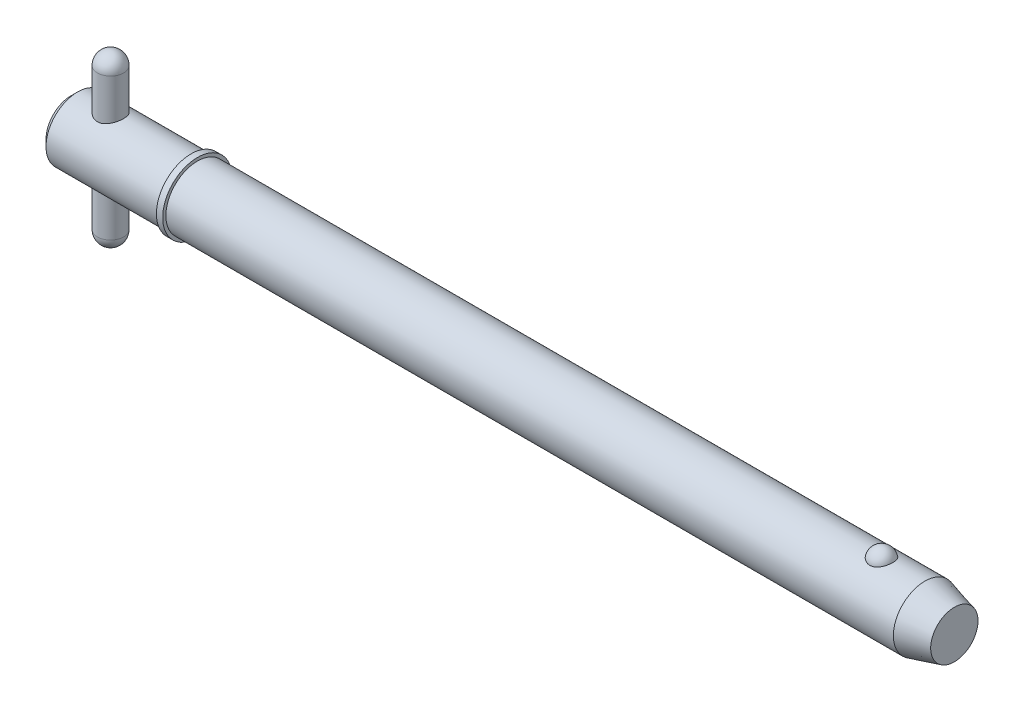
ISO-10303-21;
HEADER;
FILE_DESCRIPTION(('STEP AP214'),'2;1');
FILE_NAME('part.step','',(''),(''),'','','');
FILE_SCHEMA(('AUTOMOTIVE_DESIGN { 1 0 10303 214 1 1 1 1 }'));
ENDSEC;
DATA;
#1=APPLICATION_CONTEXT('core data for automotive mechanical design processes');
#2=APPLICATION_PROTOCOL_DEFINITION('international standard','automotive_design',2000,#1);
#3=PRODUCT_CONTEXT('',#1,'mechanical');
#4=PRODUCT('Part','Part','',(#3));
#5=PRODUCT_RELATED_PRODUCT_CATEGORY('part','',(#4));
#6=PRODUCT_DEFINITION_FORMATION('','',#4);
#7=PRODUCT_DEFINITION_CONTEXT('part definition',#1,'design');
#8=PRODUCT_DEFINITION('design','',#6,#7);
#9=PRODUCT_DEFINITION_SHAPE('','',#8);
#10=(LENGTH_UNIT() NAMED_UNIT(*) SI_UNIT(.MILLI.,.METRE.));
#11=(NAMED_UNIT(*) PLANE_ANGLE_UNIT() SI_UNIT($,.RADIAN.));
#12=(NAMED_UNIT(*) SI_UNIT($,.STERADIAN.) SOLID_ANGLE_UNIT());
#13=UNCERTAINTY_MEASURE_WITH_UNIT(LENGTH_MEASURE(1.E-05),#10,'distance_accuracy_value','');
#14=(GEOMETRIC_REPRESENTATION_CONTEXT(3) GLOBAL_UNCERTAINTY_ASSIGNED_CONTEXT((#13)) GLOBAL_UNIT_ASSIGNED_CONTEXT((#10,
#11,#12)) REPRESENTATION_CONTEXT('',''));
#15=CARTESIAN_POINT('',(0.,0.,0.));
#16=DIRECTION('',(0.,0.,1.));
#17=DIRECTION('',(1.,0.,0.));
#18=AXIS2_PLACEMENT_3D('',#15,#16,#17);
#19=CARTESIAN_POINT('',(5.94,12.7,0.));
#20=DIRECTION('',(0.,-1.,0.));
#21=DIRECTION('',(0.,0.,-1.));
#22=AXIS2_PLACEMENT_3D('',#19,#20,#21);
#23=CYLINDRICAL_SURFACE('',#22,1.98);
#24=CARTESIAN_POINT('',(5.94,-10.72,0.));
#25=DIRECTION('',(0.,-1.,0.));
#26=DIRECTION('',(0.,0.,-1.));
#27=AXIS2_PLACEMENT_3D('',#24,#25,#26);
#28=CIRCLE('',#27,1.98);
#29=CARTESIAN_POINT('',(5.94,-10.72,-1.98));
#30=VERTEX_POINT('',#29);
#31=EDGE_CURVE('P0_E10',#30,#30,#28,.F.);
#32=ORIENTED_EDGE('',*,*,#31,.T.);
#33=EDGE_LOOP('',(#32));
#34=FACE_BOUND('',#33,.T.);
#35=CARTESIAN_POINT('',(5.94,10.72,0.));
#36=DIRECTION('',(0.,-1.,0.));
#37=DIRECTION('',(0.,0.,-1.));
#38=AXIS2_PLACEMENT_3D('',#35,#36,#37);
#39=CIRCLE('',#38,1.98);
#40=CARTESIAN_POINT('',(5.94,10.72,-1.98));
#41=VERTEX_POINT('',#40);
#42=EDGE_CURVE('P0_E21',#41,#41,#39,.T.);
#43=ORIENTED_EDGE('',*,*,#42,.T.);
#44=EDGE_LOOP('',(#43));
#45=FACE_BOUND('',#44,.T.);
#46=ADVANCED_FACE('P0_F14',(#34,#45),#23,.T.);
#47=CARTESIAN_POINT('',(5.94,-10.72,0.));
#48=DIRECTION('',(0.,0.,1.));
#49=DIRECTION('',(1.,0.,0.));
#50=AXIS2_PLACEMENT_3D('',#47,#48,#49);
#51=SPHERICAL_SURFACE('',#50,1.98);
#52=CARTESIAN_POINT('',(5.94,-10.72,0.));
#53=DIRECTION('',(0.,-1.,0.));
#54=DIRECTION('',(0.,0.,-1.));
#55=AXIS2_PLACEMENT_3D('',#52,#53,#54);
#56=SPHERICAL_SURFACE('',#55,1.98);
#57=ORIENTED_EDGE('',*,*,#31,.F.);
#58=EDGE_LOOP('',(#57));
#59=FACE_BOUND('',#58,.T.);
#60=ADVANCED_FACE('P0_F29',(#59),#56,.T.);
#61=CARTESIAN_POINT('',(5.94,10.72,0.));
#62=DIRECTION('',(0.,0.,1.));
#63=DIRECTION('',(1.,0.,0.));
#64=AXIS2_PLACEMENT_3D('',#61,#62,#63);
#65=SPHERICAL_SURFACE('',#64,1.98);
#66=CARTESIAN_POINT('',(5.94,10.72,0.));
#67=DIRECTION('',(0.,-1.,0.));
#68=DIRECTION('',(0.,0.,-1.));
#69=AXIS2_PLACEMENT_3D('',#66,#67,#68);
#70=SPHERICAL_SURFACE('',#69,1.98);
#71=ORIENTED_EDGE('',*,*,#42,.F.);
#72=EDGE_LOOP('',(#71));
#73=FACE_BOUND('',#72,.T.);
#74=ADVANCED_FACE('P0_F16',(#73),#70,.T.);
#75=CLOSED_SHELL('',(#46,#60,#74));
#76=MANIFOLD_SOLID_BREP('P0_B1',#75);
#77=CARTESIAN_POINT('',(0.,0.,0.));
#78=DIRECTION('',(1.,0.,0.));
#79=DIRECTION('',(0.,0.,-1.));
#80=AXIS2_PLACEMENT_3D('',#77,#78,#79);
#81=CYLINDRICAL_SURFACE('',#80,4.765);
#82=CARTESIAN_POINT('',(128.904194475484,0.,0.));
#83=DIRECTION('',(1.,0.,0.));
#84=DIRECTION('',(0.,0.,-1.));
#85=AXIS2_PLACEMENT_3D('',#82,#83,#84);
#86=CIRCLE('',#85,4.765);
#87=CARTESIAN_POINT('',(128.904194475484,0.,-4.765));
#88=VERTEX_POINT('',#87);
#89=EDGE_CURVE('P1_E81',#88,#88,#86,.T.);
#90=ORIENTED_EDGE('',*,*,#89,.F.);
#91=EDGE_LOOP('',(#90));
#92=FACE_BOUND('',#91,.T.);
#93=CARTESIAN_POINT('',(19.05,0.,0.));
#94=DIRECTION('',(1.,0.,0.));
#95=DIRECTION('',(0.,0.,-1.));
#96=AXIS2_PLACEMENT_3D('',#93,#94,#95);
#97=CIRCLE('',#96,4.765);
#98=CARTESIAN_POINT('',(19.05,0.,-4.765));
#99=VERTEX_POINT('',#98);
#100=EDGE_CURVE('P1_E85',#99,#99,#97,.T.);
#101=ORIENTED_EDGE('',*,*,#100,.T.);
#102=EDGE_LOOP('',(#101));
#103=FACE_BOUND('',#102,.T.);
#104=CARTESIAN_POINT('',(122.351020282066,4.42764777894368,1.76101111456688));
#105=CARTESIAN_POINT('',(122.259721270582,4.42764470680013,1.76101422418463));
#106=CARTESIAN_POINT('',(122.168446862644,4.43059091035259,1.75366340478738));
#107=CARTESIAN_POINT('',(121.988615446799,4.44201846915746,1.72451180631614));
#108=CARTESIAN_POINT('',(121.900057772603,4.45049845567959,1.70271460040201));
#109=CARTESIAN_POINT('',(121.728257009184,4.47200516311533,1.6453937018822));
#110=CARTESIAN_POINT('',(121.645006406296,4.48502527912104,1.60988994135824));
#111=CARTESIAN_POINT('',(121.485763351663,4.51419542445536,1.52617873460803));
#112=CARTESIAN_POINT('',(121.409772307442,4.53034605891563,1.47796883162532));
#113=CARTESIAN_POINT('',(121.264744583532,4.5645931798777,1.36860494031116));
#114=CARTESIAN_POINT('',(121.195964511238,4.58273170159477,1.30712420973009));
#115=CARTESIAN_POINT('',(121.069342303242,4.61870302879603,1.17370204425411));
#116=CARTESIAN_POINT('',(121.011502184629,4.63653577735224,1.10175868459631));
#117=CARTESIAN_POINT('',(120.905570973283,4.67090140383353,0.945806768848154));
#118=CARTESIAN_POINT('',(120.858030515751,4.68734068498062,0.861402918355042));
#119=CARTESIAN_POINT('',(120.777081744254,4.71628466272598,0.685442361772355));
#120=CARTESIAN_POINT('',(120.743674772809,4.72878898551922,0.593884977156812));
#121=CARTESIAN_POINT('',(120.691287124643,4.74874061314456,0.404781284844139));
#122=CARTESIAN_POINT('',(120.672517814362,4.75611366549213,0.30716844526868));
#123=CARTESIAN_POINT('',(120.650584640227,4.76475393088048,0.109940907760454));
#124=CARTESIAN_POINT('',(120.647420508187,4.76602124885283,0.0103262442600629));
#125=CARTESIAN_POINT('',(120.656740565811,4.76232928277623,-0.187629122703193));
#126=CARTESIAN_POINT('',(120.669158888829,4.7573962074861,-0.285973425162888));
#127=CARTESIAN_POINT('',(120.709280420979,4.74184975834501,-0.479027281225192));
#128=CARTESIAN_POINT('',(120.736983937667,4.7312362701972,-0.573736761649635));
#129=CARTESIAN_POINT('',(120.807158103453,4.70540026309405,-0.756973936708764));
#130=CARTESIAN_POINT('',(120.849646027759,4.69017235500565,-0.845494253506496));
#131=CARTESIAN_POINT('',(120.948520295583,4.6566986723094,-1.01378033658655));
#132=CARTESIAN_POINT('',(121.004907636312,4.63845268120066,-1.09354547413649));
#133=CARTESIAN_POINT('',(121.130552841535,4.60085438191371,-1.24228523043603));
#134=CARTESIAN_POINT('',(121.199843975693,4.58149930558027,-1.31123108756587));
#135=CARTESIAN_POINT('',(121.349606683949,4.54391653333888,-1.43607409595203));
#136=CARTESIAN_POINT('',(121.430077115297,4.52568872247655,-1.49197257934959));
#137=CARTESIAN_POINT('',(121.598150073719,4.49293007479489,-1.58786764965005));
#138=CARTESIAN_POINT('',(121.685544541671,4.47832346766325,-1.62820219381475));
#139=CARTESIAN_POINT('',(121.866553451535,4.45406011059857,-1.69345757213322));
#140=CARTESIAN_POINT('',(121.96016555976,4.44440151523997,-1.71838415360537));
#141=CARTESIAN_POINT('',(122.145893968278,4.43159888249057,-1.75112843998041));
#142=CARTESIAN_POINT('',(122.237849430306,4.42815213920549,-1.75974223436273));
#143=CARTESIAN_POINT('',(122.421965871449,4.427247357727,-1.76201865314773));
#144=CARTESIAN_POINT('',(122.514126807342,4.42978816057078,-1.7556841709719));
#145=CARTESIAN_POINT('',(122.693129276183,4.4403864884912,-1.72869560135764));
#146=CARTESIAN_POINT('',(122.780047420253,4.44827555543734,-1.70847853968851));
#147=CARTESIAN_POINT('',(122.949131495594,4.46852246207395,-1.65479562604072));
#148=CARTESIAN_POINT('',(123.031297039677,4.48088066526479,-1.62132869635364));
#149=CARTESIAN_POINT('',(123.190591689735,4.50907357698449,-1.54120560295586));
#150=CARTESIAN_POINT('',(123.267570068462,4.52497884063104,-1.49427526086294));
#151=CARTESIAN_POINT('',(123.412708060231,4.55845148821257,-1.38881222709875));
#152=CARTESIAN_POINT('',(123.480865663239,4.57601924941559,-1.33027689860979));
#153=CARTESIAN_POINT('',(123.610099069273,4.61196537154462,-1.19991049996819));
#154=CARTESIAN_POINT('',(123.670656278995,4.63034074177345,-1.12756415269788));
#155=CARTESIAN_POINT('',(123.779279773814,4.66513959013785,-0.973612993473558));
#156=CARTESIAN_POINT('',(123.827343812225,4.68156271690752,-0.892006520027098));
#157=CARTESIAN_POINT('',(123.911383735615,4.71130224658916,-0.718892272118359));
#158=CARTESIAN_POINT('',(123.946918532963,4.724501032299,-0.627149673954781));
#159=CARTESIAN_POINT('',(124.002952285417,4.74571823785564,-0.438611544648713));
#160=CARTESIAN_POINT('',(124.023450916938,4.75373654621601,-0.341815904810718));
#161=CARTESIAN_POINT('',(124.049033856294,4.76378905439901,-0.145633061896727));
#162=CARTESIAN_POINT('',(124.054076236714,4.76580697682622,-0.046239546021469));
#163=CARTESIAN_POINT('',(124.048523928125,4.7636057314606,0.152038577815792));
#164=CARTESIAN_POINT('',(124.037929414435,4.75938663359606,0.250923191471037));
#165=CARTESIAN_POINT('',(124.001387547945,4.74516937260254,0.445004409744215));
#166=CARTESIAN_POINT('',(123.975496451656,4.73519238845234,0.54021317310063));
#167=CARTESIAN_POINT('',(123.908927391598,4.71049394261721,0.724662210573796));
#168=CARTESIAN_POINT('',(123.868248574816,4.69577220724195,0.81390214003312));
#169=CARTESIAN_POINT('',(123.772717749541,4.66303767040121,0.984313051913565));
#170=CARTESIAN_POINT('',(123.717804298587,4.64501070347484,1.06544688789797));
#171=CARTESIAN_POINT('',(123.595049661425,4.60764678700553,1.21692673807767));
#172=CARTESIAN_POINT('',(123.527208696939,4.58830985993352,1.2872729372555));
#173=CARTESIAN_POINT('',(123.380548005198,4.55060370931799,1.41479271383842));
#174=CARTESIAN_POINT('',(123.301791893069,4.53222967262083,1.47203785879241));
#175=CARTESIAN_POINT('',(123.134989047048,4.49849576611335,1.57212016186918));
#176=CARTESIAN_POINT('',(123.046941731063,4.48313608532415,1.61495641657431));
#177=CARTESIAN_POINT('',(122.859791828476,4.45676184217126,1.68642657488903));
#178=CARTESIAN_POINT('',(122.760365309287,4.44598302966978,1.71430590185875));
#179=CARTESIAN_POINT('',(122.557621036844,4.43142918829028,1.75159258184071));
#180=CARTESIAN_POINT('',(122.454304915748,4.42765125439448,1.76100759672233));
#181=CARTESIAN_POINT('',(122.351020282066,4.42764777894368,1.76101111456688));
#182=B_SPLINE_CURVE_WITH_KNOTS('',3,(#104,#105,#106,#107,#108,#109,#110,#111,#112,#113,#114,
#115,#116,#117,#118,#119,#120,#121,#122,#123,#124,#125,#126,#127,#128,#129,#130,#131,#132,#133,
#134,#135,#136,#137,#138,#139,#140,#141,#142,#143,#144,#145,#146,#147,#148,#149,#150,#151,#152,
#153,#154,#155,#156,#157,#158,#159,#160,#161,#162,#163,#164,#165,#166,#167,#168,#169,#170,#171,
#172,#173,#174,#175,#176,#177,#178,#179,#180,#181),.UNSPECIFIED.,.T.,.F.,(4,2,2,2,2,2,2,2,2,2,2,
2,2,2,2,2,2,2,2,2,2,2,2,2,2,2,2,2,2,2,2,2,2,2,2,2,2,2,4),(0.,0.273517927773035,
0.546968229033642,0.820022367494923,1.09312934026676,1.37393946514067,1.65480131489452,
1.94820420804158,2.24163496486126,2.53922817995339,2.8368162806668,3.13315071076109,
3.42949110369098,3.72617893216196,4.02288805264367,4.32037303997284,4.61782764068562,
4.90840095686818,5.19886582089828,5.4747485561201,5.75057789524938,6.01809977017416,
6.2856434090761,6.55907787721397,6.83257454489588,7.11962987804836,7.40673679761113,
7.70312663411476,7.99952284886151,8.29672237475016,8.59391856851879,8.89002850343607,
9.18615552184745,9.483582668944,9.78100471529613,10.0767610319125,10.3725358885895,
10.6820893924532,10.991514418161),.UNSPECIFIED.);
#183=CARTESIAN_POINT('',(122.351020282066,4.42764777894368,1.76101111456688));
#184=VERTEX_POINT('',#183);
#185=EDGE_CURVE('P1_E35',#184,#184,#182,.T.);
#186=ORIENTED_EDGE('',*,*,#185,.T.);
#187=EDGE_LOOP('',(#186));
#188=FACE_BOUND('',#187,.T.);
#189=ADVANCED_FACE('P1_F13',(#92,#103,#188),#81,.T.);
#190=CARTESIAN_POINT('',(0.,0.,0.));
#191=DIRECTION('',(-1.,0.,0.));
#192=DIRECTION('',(0.,0.,1.));
#193=AXIS2_PLACEMENT_3D('',#190,#191,#192);
#194=PLANE('',#193);
#195=CARTESIAN_POINT('',(0.,0.,0.));
#196=DIRECTION('',(1.,0.,0.));
#197=DIRECTION('',(0.,0.,-1.));
#198=AXIS2_PLACEMENT_3D('',#195,#196,#197);
#199=CIRCLE('',#198,3.812);
#200=CARTESIAN_POINT('',(0.,0.,-3.812));
#201=VERTEX_POINT('',#200);
#202=EDGE_CURVE('P1_E9',#201,#201,#199,.T.);
#203=ORIENTED_EDGE('',*,*,#202,.F.);
#204=EDGE_LOOP('',(#203));
#205=FACE_BOUND('',#204,.T.);
#206=ADVANCED_FACE('P1_F15',(#205),#194,.T.);
#207=CARTESIAN_POINT('',(0.952999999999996,0.,0.));
#208=DIRECTION('',(1.,0.,0.));
#209=DIRECTION('',(0.,0.,-1.));
#210=AXIS2_PLACEMENT_3D('',#207,#208,#209);
#211=CONICAL_SURFACE('',#210,4.765,0.78539816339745);
#212=ORIENTED_EDGE('',*,*,#202,.T.);
#213=EDGE_LOOP('',(#212));
#214=FACE_BOUND('',#213,.T.);
#215=CARTESIAN_POINT('',(0.952999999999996,0.,0.));
#216=DIRECTION('',(1.,0.,0.));
#217=DIRECTION('',(0.,0.,-1.));
#218=AXIS2_PLACEMENT_3D('',#215,#216,#217);
#219=CIRCLE('',#218,4.765);
#220=CARTESIAN_POINT('',(0.952999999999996,0.,-4.765));
#221=VERTEX_POINT('',#220);
#222=EDGE_CURVE('P1_E26',#221,#221,#219,.T.);
#223=ORIENTED_EDGE('',*,*,#222,.F.);
#224=EDGE_LOOP('',(#223));
#225=FACE_BOUND('',#224,.T.);
#226=ADVANCED_FACE('P1_F77',(#214,#225),#211,.T.);
#227=CARTESIAN_POINT('',(0.,0.,0.));
#228=DIRECTION('',(1.,0.,0.));
#229=DIRECTION('',(0.,0.,-1.));
#230=AXIS2_PLACEMENT_3D('',#227,#228,#229);
#231=CYLINDRICAL_SURFACE('',#230,4.765);
#232=CARTESIAN_POINT('',(5.94,-4.33414639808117,1.98));
#233=CARTESIAN_POINT('',(5.83435484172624,-4.33415447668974,1.97999169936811));
#234=CARTESIAN_POINT('',(5.72854887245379,-4.33806396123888,1.97149330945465));
#235=CARTESIAN_POINT('',(5.51998191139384,-4.35319906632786,1.93783487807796));
#236=CARTESIAN_POINT('',(5.41723000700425,-4.3644446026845,1.91262947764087));
#237=CARTESIAN_POINT('',(5.21817294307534,-4.39274225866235,1.84670269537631));
#238=CARTESIAN_POINT('',(5.12184344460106,-4.40977076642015,1.80604432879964));
#239=CARTESIAN_POINT('',(4.93740039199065,-4.44768106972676,1.71055160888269));
#240=CARTESIAN_POINT('',(4.84928487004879,-4.46856193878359,1.65572066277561));
#241=CARTESIAN_POINT('',(4.67826533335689,-4.51326966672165,1.52981120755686));
#242=CARTESIAN_POINT('',(4.59593118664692,-4.53719608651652,1.45799365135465));
#243=CARTESIAN_POINT('',(4.44405452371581,-4.58448035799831,1.30170177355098));
#244=CARTESIAN_POINT('',(4.37451692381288,-4.60783798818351,1.21722260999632));
#245=CARTESIAN_POINT('',(4.24730683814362,-4.65256187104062,1.03353484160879));
#246=CARTESIAN_POINT('',(4.19027484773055,-4.67379892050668,0.933848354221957));
#247=CARTESIAN_POINT('',(4.0940363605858,-4.7106711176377,0.7252544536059));
#248=CARTESIAN_POINT('',(4.05482199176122,-4.72630873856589,0.61635113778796));
#249=CARTESIAN_POINT('',(3.99739515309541,-4.74951416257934,0.398397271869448));
#250=CARTESIAN_POINT('',(3.97820018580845,-4.7574579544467,0.289646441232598));
#251=CARTESIAN_POINT('',(3.95818309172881,-4.76574596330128,0.0701967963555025));
#252=CARTESIAN_POINT('',(3.95735355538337,-4.76609324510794,-0.0405012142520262));
#253=CARTESIAN_POINT('',(3.9735743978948,-4.75937098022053,-0.253561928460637));
#254=CARTESIAN_POINT('',(3.98954548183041,-4.75274912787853,-0.356023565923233));
#255=CARTESIAN_POINT('',(4.03706504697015,-4.73344665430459,-0.556659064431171));
#256=CARTESIAN_POINT('',(4.06861467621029,-4.72076558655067,-0.654832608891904));
#257=CARTESIAN_POINT('',(4.14677192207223,-4.69032846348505,-0.845904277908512));
#258=CARTESIAN_POINT('',(4.19360181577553,-4.67249797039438,-0.938699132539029));
#259=CARTESIAN_POINT('',(4.30077315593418,-4.63350852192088,-1.11535616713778));
#260=CARTESIAN_POINT('',(4.3611193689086,-4.61234839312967,-1.19921518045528));
#261=CARTESIAN_POINT('',(4.49853487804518,-4.56707259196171,-1.3618711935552));
#262=CARTESIAN_POINT('',(4.57648039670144,-4.5428537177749,-1.43990029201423));
#263=CARTESIAN_POINT('',(4.74440779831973,-4.49530722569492,-1.58211009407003));
#264=CARTESIAN_POINT('',(4.83439425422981,-4.47197995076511,-1.64628551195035));
#265=CARTESIAN_POINT('',(5.02755026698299,-4.42812342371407,-1.76092221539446));
#266=CARTESIAN_POINT('',(5.13105348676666,-4.40770990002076,-1.81086937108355));
#267=CARTESIAN_POINT('',(5.34607555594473,-4.37336901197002,-1.89231211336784));
#268=CARTESIAN_POINT('',(5.45758864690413,-4.3594370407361,-1.92382080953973));
#269=CARTESIAN_POINT('',(5.67777275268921,-4.34077746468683,-1.96554536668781));
#270=CARTESIAN_POINT('',(5.78616167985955,-4.33551319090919,-1.9770057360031));
#271=CARTESIAN_POINT('',(6.00341835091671,-4.33325118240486,-1.98196183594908));
#272=CARTESIAN_POINT('',(6.11228591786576,-4.33625061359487,-1.97546372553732));
#273=CARTESIAN_POINT('',(6.32012423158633,-4.34962383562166,-1.94582288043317));
#274=CARTESIAN_POINT('',(6.41928436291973,-4.35951709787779,-1.92376364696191));
#275=CARTESIAN_POINT('',(6.61241543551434,-4.38495043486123,-1.86506038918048));
#276=CARTESIAN_POINT('',(6.70638516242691,-4.40049182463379,-1.82841296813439));
#277=CARTESIAN_POINT('',(6.89090272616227,-4.43627016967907,-1.73985559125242));
#278=CARTESIAN_POINT('',(6.98113841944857,-4.45667771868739,-1.68736639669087));
#279=CARTESIAN_POINT('',(7.1519532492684,-4.49964530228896,-1.56919282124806));
#280=CARTESIAN_POINT('',(7.232528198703,-4.52220626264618,-1.50350275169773));
#281=CARTESIAN_POINT('',(7.38851617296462,-4.56914071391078,-1.35452895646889));
#282=CARTESIAN_POINT('',(7.46298462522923,-4.5935132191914,-1.27025197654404));
#283=CARTESIAN_POINT('',(7.59689029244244,-4.63962841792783,-1.08983181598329));
#284=CARTESIAN_POINT('',(7.65632644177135,-4.66137092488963,-0.993687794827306));
#285=CARTESIAN_POINT('',(7.75840361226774,-4.69991192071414,-0.791608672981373));
#286=CARTESIAN_POINT('',(7.80100481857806,-4.71669866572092,-0.685651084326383));
#287=CARTESIAN_POINT('',(7.86746997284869,-4.74331408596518,-0.467197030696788));
#288=CARTESIAN_POINT('',(7.8913450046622,-4.75314687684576,-0.354704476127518));
#289=CARTESIAN_POINT('',(7.91828971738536,-4.76427543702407,-0.134819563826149));
#290=CARTESIAN_POINT('',(7.92269147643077,-4.76611762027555,-0.027616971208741));
#291=CARTESIAN_POINT('',(7.91414154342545,-4.76256684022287,0.185959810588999));
#292=CARTESIAN_POINT('',(7.90119286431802,-4.75717513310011,0.292334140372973));
#293=CARTESIAN_POINT('',(7.85926572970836,-4.74004856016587,0.497383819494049));
#294=CARTESIAN_POINT('',(7.83086647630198,-4.72854322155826,0.596198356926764));
#295=CARTESIAN_POINT('',(7.75947503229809,-4.70045111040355,0.787624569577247));
#296=CARTESIAN_POINT('',(7.71648006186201,-4.68386336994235,0.880235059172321));
#297=CARTESIAN_POINT('',(7.6149456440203,-4.64628321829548,1.06122875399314));
#298=CARTESIAN_POINT('',(7.55579211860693,-4.62512577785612,1.14923242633));
#299=CARTESIAN_POINT('',(7.42451813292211,-4.58091700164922,1.31443888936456));
#300=CARTESIAN_POINT('',(7.35239289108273,-4.5578649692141,1.39163767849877));
#301=CARTESIAN_POINT('',(7.19146107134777,-4.51050832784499,1.53847013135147));
#302=CARTESIAN_POINT('',(7.10185635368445,-4.48622440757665,1.60723941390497));
#303=CARTESIAN_POINT('',(6.91164948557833,-4.44076541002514,1.72888900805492));
#304=CARTESIAN_POINT('',(6.81104124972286,-4.41959206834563,1.78176046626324));
#305=CARTESIAN_POINT('',(6.60181953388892,-4.38318936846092,1.86953227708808));
#306=CARTESIAN_POINT('',(6.49325511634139,-4.3679267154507,1.90453365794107));
#307=CARTESIAN_POINT('',(6.32681512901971,-4.35102038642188,1.94268459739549));
#308=CARTESIAN_POINT('',(6.27079191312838,-4.34638447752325,1.953006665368));
#309=CARTESIAN_POINT('',(6.15793999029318,-4.33925923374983,1.96879053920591));
#310=CARTESIAN_POINT('',(6.10111188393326,-4.33676837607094,1.97425579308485));
#311=CARTESIAN_POINT('',(6.00947316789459,-4.33456308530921,1.97908711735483));
#312=CARTESIAN_POINT('',(5.97474528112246,-4.33414374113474,1.98000272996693));
#313=CARTESIAN_POINT('',(5.94,-4.33414639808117,1.98));
#314=B_SPLINE_CURVE_WITH_KNOTS('',3,(#232,#233,#234,#235,#236,#237,#238,#239,#240,#241,#242,
#243,#244,#245,#246,#247,#248,#249,#250,#251,#252,#253,#254,#255,#256,#257,#258,#259,#260,#261,
#262,#263,#264,#265,#266,#267,#268,#269,#270,#271,#272,#273,#274,#275,#276,#277,#278,#279,#280,
#281,#282,#283,#284,#285,#286,#287,#288,#289,#290,#291,#292,#293,#294,#295,#296,#297,#298,#299,
#300,#301,#302,#303,#304,#305,#306,#307,#308,#309,#310,#311,#312,#313),.UNSPECIFIED.,.T.,.F.,(4,
2,2,2,2,2,2,2,2,2,2,2,2,2,2,2,2,2,2,2,2,2,2,2,2,2,2,2,2,2,2,2,2,2,2,2,2,2,2,2,4),(0.,
0.316814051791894,0.634491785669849,0.950887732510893,1.2672076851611,1.60127705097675,
1.93547449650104,2.28407463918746,2.63252061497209,2.96292077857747,3.29318763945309,
3.60346227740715,3.91375978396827,4.22878888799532,4.54392926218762,4.88117914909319,
5.21855748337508,5.56691259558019,5.91501972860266,6.24062939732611,6.56612741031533,
6.87094948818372,7.17584258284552,7.49361276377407,7.81152017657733,8.15513975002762,
8.4987836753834,8.8432355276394,9.18748334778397,9.50777781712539,9.8280166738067,
10.1370037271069,10.4460496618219,10.7690461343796,11.0921619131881,11.4371238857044,
11.7822776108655,12.1254577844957,12.2967183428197,12.4678572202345,12.5720531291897),.UNSPECIFIED.);
#315=CARTESIAN_POINT('',(5.94,-4.33414639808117,1.98));
#316=VERTEX_POINT('',#315);
#317=EDGE_CURVE('P1_E17',#316,#316,#314,.T.);
#318=ORIENTED_EDGE('',*,*,#317,.F.);
#319=EDGE_LOOP('',(#318));
#320=FACE_BOUND('',#319,.T.);
#321=CARTESIAN_POINT('',(5.94,4.33414639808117,1.98));
#322=CARTESIAN_POINT('',(6.04564515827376,4.33415447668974,1.97999169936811));
#323=CARTESIAN_POINT('',(6.15145112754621,4.33806396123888,1.97149330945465));
#324=CARTESIAN_POINT('',(6.36001808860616,4.35319906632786,1.93783487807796));
#325=CARTESIAN_POINT('',(6.46276999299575,4.3644446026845,1.91262947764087));
#326=CARTESIAN_POINT('',(6.66182705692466,4.39274225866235,1.84670269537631));
#327=CARTESIAN_POINT('',(6.75815655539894,4.40977076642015,1.80604432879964));
#328=CARTESIAN_POINT('',(6.94259960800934,4.44768106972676,1.71055160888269));
#329=CARTESIAN_POINT('',(7.03071512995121,4.46856193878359,1.65572066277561));
#330=CARTESIAN_POINT('',(7.20173466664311,4.51326966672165,1.52981120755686));
#331=CARTESIAN_POINT('',(7.28406881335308,4.53719608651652,1.45799365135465));
#332=CARTESIAN_POINT('',(7.43594547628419,4.58448035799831,1.30170177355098));
#333=CARTESIAN_POINT('',(7.50548307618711,4.60783798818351,1.21722260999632));
#334=CARTESIAN_POINT('',(7.63269316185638,4.65256187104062,1.03353484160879));
#335=CARTESIAN_POINT('',(7.68972515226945,4.67379892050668,0.933848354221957));
#336=CARTESIAN_POINT('',(7.7859636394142,4.7106711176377,0.7252544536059));
#337=CARTESIAN_POINT('',(7.82517800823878,4.72630873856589,0.61635113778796));
#338=CARTESIAN_POINT('',(7.88260484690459,4.74951416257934,0.398397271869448));
#339=CARTESIAN_POINT('',(7.90179981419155,4.7574579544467,0.289646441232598));
#340=CARTESIAN_POINT('',(7.92181690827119,4.76574596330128,0.0701967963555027));
#341=CARTESIAN_POINT('',(7.92264644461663,4.76609324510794,-0.040501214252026));
#342=CARTESIAN_POINT('',(7.9064256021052,4.75937098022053,-0.253561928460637));
#343=CARTESIAN_POINT('',(7.89045451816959,4.75274912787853,-0.356023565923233));
#344=CARTESIAN_POINT('',(7.84293495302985,4.73344665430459,-0.55665906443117));
#345=CARTESIAN_POINT('',(7.81138532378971,4.72076558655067,-0.654832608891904));
#346=CARTESIAN_POINT('',(7.73322807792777,4.69032846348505,-0.845904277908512));
#347=CARTESIAN_POINT('',(7.68639818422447,4.67249797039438,-0.938699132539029));
#348=CARTESIAN_POINT('',(7.57922684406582,4.63350852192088,-1.11535616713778));
#349=CARTESIAN_POINT('',(7.5188806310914,4.61234839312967,-1.19921518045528));
#350=CARTESIAN_POINT('',(7.38146512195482,4.56707259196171,-1.3618711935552));
#351=CARTESIAN_POINT('',(7.30351960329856,4.5428537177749,-1.43990029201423));
#352=CARTESIAN_POINT('',(7.13559220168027,4.49530722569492,-1.58211009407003));
#353=CARTESIAN_POINT('',(7.04560574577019,4.47197995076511,-1.64628551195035));
#354=CARTESIAN_POINT('',(6.85244973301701,4.42812342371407,-1.76092221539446));
#355=CARTESIAN_POINT('',(6.74894651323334,4.40770990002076,-1.81086937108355));
#356=CARTESIAN_POINT('',(6.53392444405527,4.37336901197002,-1.89231211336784));
#357=CARTESIAN_POINT('',(6.42241135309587,4.3594370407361,-1.92382080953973));
#358=CARTESIAN_POINT('',(6.20222724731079,4.34077746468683,-1.96554536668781));
#359=CARTESIAN_POINT('',(6.09383832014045,4.33551319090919,-1.9770057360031));
#360=CARTESIAN_POINT('',(5.87658164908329,4.33325118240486,-1.98196183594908));
#361=CARTESIAN_POINT('',(5.76771408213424,4.33625061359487,-1.97546372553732));
#362=CARTESIAN_POINT('',(5.55987576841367,4.34962383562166,-1.94582288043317));
#363=CARTESIAN_POINT('',(5.46071563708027,4.35951709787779,-1.92376364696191));
#364=CARTESIAN_POINT('',(5.26758456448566,4.38495043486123,-1.86506038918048));
#365=CARTESIAN_POINT('',(5.17361483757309,4.40049182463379,-1.82841296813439));
#366=CARTESIAN_POINT('',(4.98909727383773,4.43627016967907,-1.73985559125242));
#367=CARTESIAN_POINT('',(4.89886158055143,4.45667771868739,-1.68736639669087));
#368=CARTESIAN_POINT('',(4.72804675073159,4.49964530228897,-1.56919282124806));
#369=CARTESIAN_POINT('',(4.647471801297,4.52220626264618,-1.50350275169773));
#370=CARTESIAN_POINT('',(4.49148382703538,4.56914071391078,-1.35452895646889));
#371=CARTESIAN_POINT('',(4.41701537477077,4.5935132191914,-1.27025197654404));
#372=CARTESIAN_POINT('',(4.28310970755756,4.63962841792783,-1.08983181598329));
#373=CARTESIAN_POINT('',(4.22367355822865,4.66137092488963,-0.993687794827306));
#374=CARTESIAN_POINT('',(4.12159638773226,4.69991192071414,-0.791608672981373));
#375=CARTESIAN_POINT('',(4.07899518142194,4.71669866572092,-0.685651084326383));
#376=CARTESIAN_POINT('',(4.01253002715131,4.74331408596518,-0.467197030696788));
#377=CARTESIAN_POINT('',(3.98865499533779,4.75314687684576,-0.354704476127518));
#378=CARTESIAN_POINT('',(3.96171028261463,4.76427543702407,-0.134819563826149));
#379=CARTESIAN_POINT('',(3.95730852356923,4.76611762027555,-0.0276169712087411));
#380=CARTESIAN_POINT('',(3.96585845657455,4.76256684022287,0.185959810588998));
#381=CARTESIAN_POINT('',(3.97880713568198,4.75717513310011,0.292334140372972));
#382=CARTESIAN_POINT('',(4.02073427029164,4.74004856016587,0.497383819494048));
#383=CARTESIAN_POINT('',(4.04913352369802,4.72854322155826,0.596198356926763));
#384=CARTESIAN_POINT('',(4.12052496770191,4.70045111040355,0.787624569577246));
#385=CARTESIAN_POINT('',(4.16351993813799,4.68386336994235,0.880235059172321));
#386=CARTESIAN_POINT('',(4.2650543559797,4.64628321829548,1.06122875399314));
#387=CARTESIAN_POINT('',(4.32420788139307,4.62512577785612,1.14923242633));
#388=CARTESIAN_POINT('',(4.45548186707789,4.58091700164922,1.31443888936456));
#389=CARTESIAN_POINT('',(4.52760710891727,4.5578649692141,1.39163767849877));
#390=CARTESIAN_POINT('',(4.68853892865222,4.51050832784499,1.53847013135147));
#391=CARTESIAN_POINT('',(4.77814364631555,4.48622440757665,1.60723941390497));
#392=CARTESIAN_POINT('',(4.96835051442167,4.44076541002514,1.72888900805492));
#393=CARTESIAN_POINT('',(5.06895875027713,4.41959206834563,1.78176046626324));
#394=CARTESIAN_POINT('',(5.27818046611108,4.38318936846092,1.86953227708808));
#395=CARTESIAN_POINT('',(5.38674488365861,4.3679267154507,1.90453365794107));
#396=CARTESIAN_POINT('',(5.55318487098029,4.35102038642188,1.94268459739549));
#397=CARTESIAN_POINT('',(5.60920808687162,4.34638447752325,1.953006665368));
#398=CARTESIAN_POINT('',(5.72206000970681,4.33925923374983,1.96879053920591));
#399=CARTESIAN_POINT('',(5.77888811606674,4.33676837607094,1.97425579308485));
#400=CARTESIAN_POINT('',(5.87052683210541,4.33456308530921,1.97908711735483));
#401=CARTESIAN_POINT('',(5.90525471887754,4.33414374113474,1.98000272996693));
#402=CARTESIAN_POINT('',(5.94,4.33414639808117,1.98));
#403=B_SPLINE_CURVE_WITH_KNOTS('',3,(#321,#322,#323,#324,#325,#326,#327,#328,#329,#330,#331,
#332,#333,#334,#335,#336,#337,#338,#339,#340,#341,#342,#343,#344,#345,#346,#347,#348,#349,#350,
#351,#352,#353,#354,#355,#356,#357,#358,#359,#360,#361,#362,#363,#364,#365,#366,#367,#368,#369,
#370,#371,#372,#373,#374,#375,#376,#377,#378,#379,#380,#381,#382,#383,#384,#385,#386,#387,#388,
#389,#390,#391,#392,#393,#394,#395,#396,#397,#398,#399,#400,#401,#402),.UNSPECIFIED.,.T.,.F.,(4,
2,2,2,2,2,2,2,2,2,2,2,2,2,2,2,2,2,2,2,2,2,2,2,2,2,2,2,2,2,2,2,2,2,2,2,2,2,2,2,4),(0.,
0.316814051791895,0.634491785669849,0.950887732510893,1.2672076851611,1.60127705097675,
1.93547449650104,2.28407463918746,2.63252061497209,2.96292077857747,3.29318763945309,
3.60346227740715,3.91375978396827,4.22878888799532,4.54392926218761,4.88117914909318,
5.21855748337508,5.56691259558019,5.91501972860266,6.24062939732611,6.56612741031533,
6.87094948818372,7.17584258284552,7.49361276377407,7.81152017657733,8.15513975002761,
8.4987836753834,8.84323552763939,9.18748334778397,9.50777781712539,9.8280166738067,
10.1370037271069,10.4460496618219,10.7690461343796,11.0921619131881,11.4371238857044,
11.7822776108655,12.1254577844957,12.2967183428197,12.4678572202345,12.5720531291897),.UNSPECIFIED.);
#404=CARTESIAN_POINT('',(5.94,4.33414639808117,1.98));
#405=VERTEX_POINT('',#404);
#406=EDGE_CURVE('P1_E43',#405,#405,#403,.T.);
#407=ORIENTED_EDGE('',*,*,#406,.F.);
#408=EDGE_LOOP('',(#407));
#409=FACE_BOUND('',#408,.T.);
#410=ORIENTED_EDGE('',*,*,#222,.T.);
#411=EDGE_LOOP('',(#410));
#412=FACE_BOUND('',#411,.T.);
#413=CARTESIAN_POINT('',(18.097,0.,0.));
#414=DIRECTION('',(1.,0.,0.));
#415=DIRECTION('',(0.,0.,-1.));
#416=AXIS2_PLACEMENT_3D('',#413,#414,#415);
#417=CIRCLE('',#416,4.765);
#418=CARTESIAN_POINT('',(18.097,0.,-4.765));
#419=VERTEX_POINT('',#418);
#420=EDGE_CURVE('P1_E31',#419,#419,#417,.T.);
#421=ORIENTED_EDGE('',*,*,#420,.F.);
#422=EDGE_LOOP('',(#421));
#423=FACE_BOUND('',#422,.T.);
#424=ADVANCED_FACE('P1_F103',(#320,#409,#412,#423),#231,.T.);
#425=CARTESIAN_POINT('',(18.097,4.765,0.));
#426=DIRECTION('',(-1.,0.,0.));
#427=DIRECTION('',(0.,0.,1.));
#428=AXIS2_PLACEMENT_3D('',#425,#426,#427);
#429=PLANE('',#428);
#430=ORIENTED_EDGE('',*,*,#420,.T.);
#431=EDGE_LOOP('',(#430));
#432=FACE_BOUND('',#431,.T.);
#433=CARTESIAN_POINT('',(18.097,0.,0.));
#434=DIRECTION('',(1.,0.,0.));
#435=DIRECTION('',(0.,0.,-1.));
#436=AXIS2_PLACEMENT_3D('',#433,#434,#435);
#437=CIRCLE('',#436,5.2415);
#438=CARTESIAN_POINT('',(18.097,0.,-5.2415));
#439=VERTEX_POINT('',#438);
#440=EDGE_CURVE('P1_E91',#439,#439,#437,.T.);
#441=ORIENTED_EDGE('',*,*,#440,.F.);
#442=EDGE_LOOP('',(#441));
#443=FACE_BOUND('',#442,.T.);
#444=ADVANCED_FACE('P1_F100',(#432,#443),#429,.T.);
#445=CARTESIAN_POINT('',(0.,0.,0.));
#446=DIRECTION('',(1.,0.,0.));
#447=DIRECTION('',(0.,0.,-1.));
#448=AXIS2_PLACEMENT_3D('',#445,#446,#447);
#449=CYLINDRICAL_SURFACE('',#448,5.2415);
#450=ORIENTED_EDGE('',*,*,#440,.T.);
#451=EDGE_LOOP('',(#450));
#452=FACE_BOUND('',#451,.T.);
#453=CARTESIAN_POINT('',(19.05,0.,0.));
#454=DIRECTION('',(1.,0.,0.));
#455=DIRECTION('',(0.,0.,-1.));
#456=AXIS2_PLACEMENT_3D('',#453,#454,#455);
#457=CIRCLE('',#456,5.2415);
#458=CARTESIAN_POINT('',(19.05,0.,-5.2415));
#459=VERTEX_POINT('',#458);
#460=EDGE_CURVE('P1_E88',#459,#459,#457,.T.);
#461=ORIENTED_EDGE('',*,*,#460,.F.);
#462=EDGE_LOOP('',(#461));
#463=FACE_BOUND('',#462,.T.);
#464=ADVANCED_FACE('P1_F68',(#452,#463),#449,.T.);
#465=CARTESIAN_POINT('',(19.05,5.2415,0.));
#466=DIRECTION('',(1.,0.,0.));
#467=DIRECTION('',(0.,0.,-1.));
#468=AXIS2_PLACEMENT_3D('',#465,#466,#467);
#469=PLANE('',#468);
#470=ORIENTED_EDGE('',*,*,#460,.T.);
#471=EDGE_LOOP('',(#470));
#472=FACE_BOUND('',#471,.T.);
#473=ORIENTED_EDGE('',*,*,#100,.F.);
#474=EDGE_LOOP('',(#473));
#475=FACE_BOUND('',#474,.T.);
#476=ADVANCED_FACE('P1_F62',(#472,#475),#469,.T.);
#477=CARTESIAN_POINT('',(133.35,0.,0.));
#478=DIRECTION('',(-1.,0.,0.));
#479=DIRECTION('',(0.,0.,1.));
#480=AXIS2_PLACEMENT_3D('',#477,#478,#479);
#481=CONICAL_SURFACE('',#480,3.57375000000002,0.261799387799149);
#482=ORIENTED_EDGE('',*,*,#89,.T.);
#483=EDGE_LOOP('',(#482));
#484=FACE_BOUND('',#483,.T.);
#485=CARTESIAN_POINT('',(133.35,0.,0.));
#486=DIRECTION('',(1.,0.,0.));
#487=DIRECTION('',(0.,0.,-1.));
#488=AXIS2_PLACEMENT_3D('',#485,#486,#487);
#489=CIRCLE('',#488,3.57375000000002);
#490=CARTESIAN_POINT('',(133.35,0.,-3.57375000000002));
#491=VERTEX_POINT('',#490);
#492=EDGE_CURVE('P1_E42',#491,#491,#489,.T.);
#493=ORIENTED_EDGE('',*,*,#492,.F.);
#494=EDGE_LOOP('',(#493));
#495=FACE_BOUND('',#494,.T.);
#496=ADVANCED_FACE('P1_F59',(#484,#495),#481,.T.);
#497=CARTESIAN_POINT('',(133.35,3.57375000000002,0.));
#498=DIRECTION('',(1.,0.,0.));
#499=DIRECTION('',(0.,0.,-1.));
#500=AXIS2_PLACEMENT_3D('',#497,#498,#499);
#501=PLANE('',#500);
#502=ORIENTED_EDGE('',*,*,#492,.T.);
#503=EDGE_LOOP('',(#502));
#504=FACE_BOUND('',#503,.T.);
#505=ADVANCED_FACE('P1_F55',(#504),#501,.T.);
#506=CARTESIAN_POINT('',(122.351020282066,4.2885,0.));
#507=DIRECTION('',(-1.,0.,0.));
#508=DIRECTION('',(0.,1.,0.));
#509=AXIS2_PLACEMENT_3D('',#506,#507,#508);
#510=SPHERICAL_SURFACE('',#509,1.7665);
#511=ORIENTED_EDGE('',*,*,#185,.F.);
#512=EDGE_LOOP('',(#511));
#513=FACE_BOUND('',#512,.T.);
#514=ADVANCED_FACE('P1_F50',(#513),#510,.T.);
#515=CARTESIAN_POINT('',(5.94,-5.2415,0.));
#516=DIRECTION('',(0.,1.,0.));
#517=DIRECTION('',(0.,0.,1.));
#518=AXIS2_PLACEMENT_3D('',#515,#516,#517);
#519=CYLINDRICAL_SURFACE('',#518,1.98);
#520=ORIENTED_EDGE('',*,*,#317,.T.);
#521=EDGE_LOOP('',(#520));
#522=FACE_BOUND('',#521,.T.);
#523=ORIENTED_EDGE('',*,*,#406,.T.);
#524=EDGE_LOOP('',(#523));
#525=FACE_BOUND('',#524,.T.);
#526=ADVANCED_FACE('P1_F54',(#522,#525),#519,.F.);
#527=CLOSED_SHELL('',(#189,#206,#226,#424,#444,#464,#476,#496,#505,#514,#526));
#528=MANIFOLD_SOLID_BREP('P1_B1',#527);
#529=ADVANCED_BREP_SHAPE_REPRESENTATION('',(#18,#76,#528),#14);
#530=SHAPE_DEFINITION_REPRESENTATION(#9,#529);
ENDSEC;
END-ISO-10303-21;
